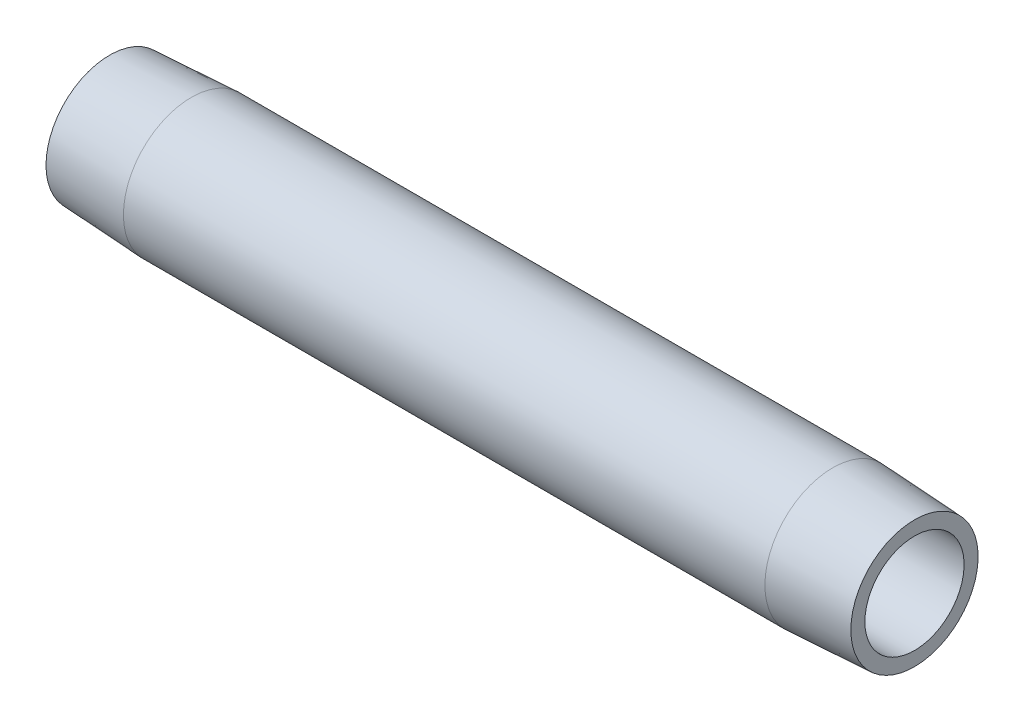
from build123d import *


with BuildPart() as part:
    # Sketch1 → Revolve1 (revolve)
    with BuildSketch(Plane.XY, mode=Mode.PRIVATE) as revolve1_sk:
        Polygon((101.6, 6.2611), (0, 6.2611), (0, 8.032050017), (10.3124, 8.5725), (91.2876, 8.5725), (101.6, 8.032050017), align=None)
    revolve(revolve1_sk.sketch.rotate(Axis((0, 0, 0), (1, 0, 0)), 90), axis=Axis((0, 0, 0), (1, 0, 0)))


solid = part.part
